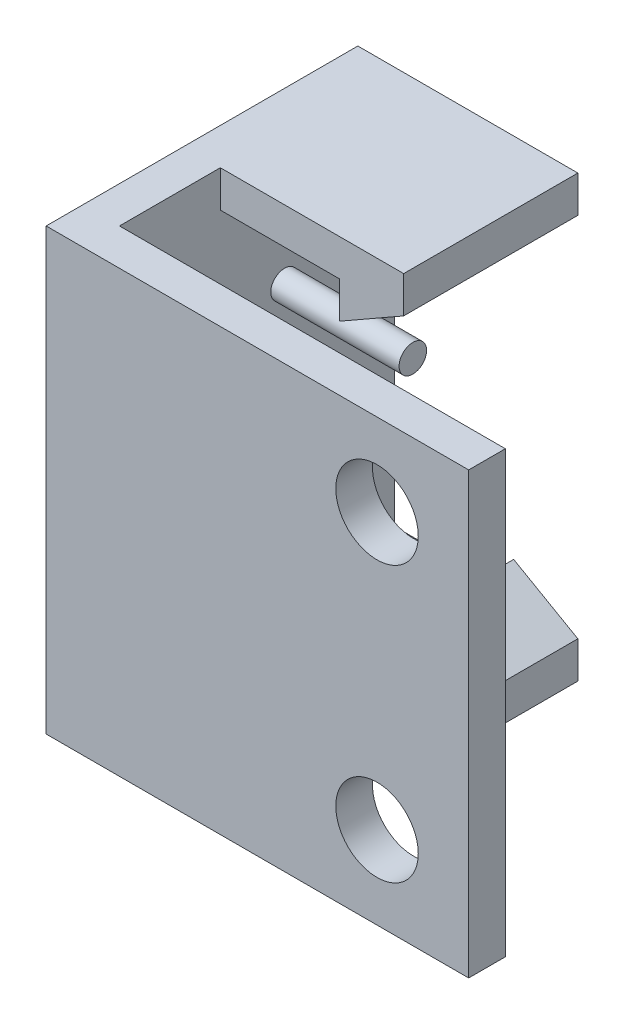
from build123d import *

# Parameters (mm, degrees)
SKIZZE1_W                       = 15
SKIZZE1_H                       = 24
AUFSATZ_LINEAR_AUSTRAGEN1_DEPTH = 2
SKIZZE2_W                       = 15
SKIZZE2_H                       = 2
AUFSATZ_LINEAR_AUSTRAGEN2_DEPTH = 10
AUFSATZ_LINEAR_AUSTRAGEN3_DEPTH = 10
SKIZZE7_W                       = 23.045869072
SKIZZE7_H                       = 24
SKIZZE7_R                       = 2.25
AUFSATZ_LINEAR_AUSTRAGEN4_DEPTH = 2
SKIZZE5_R                       = 0.75
AUFSATZ_LINEAR_AUSTRAGEN5_DEPTH = 7
SKIZZE8_W                       = 10
SKIZZE8_H                       = 5.5
SCHNITT_LINEAR_AUSTRAGEN2_DEPTH = 27


with BuildPart() as part:
    # Skizze1 → Aufsatz-Linear austragen1 (new body)
    with BuildSketch(Plane(origin=(0, 0, 0), x_dir=(0, 0, -1), z_dir=(1, 0, 0))):
        with Locations((7.5, 12)):
            Rectangle(SKIZZE1_W, SKIZZE1_H)
    extrude(amount=AUFSATZ_LINEAR_AUSTRAGEN1_DEPTH)

    # Skizze2 → Aufsatz-Linear austragen2 (add)
    with BuildSketch(Plane(origin=(2, 0, 0), x_dir=(0, 0, -1), z_dir=(1, 0, 0))):
        with Locations((7.5, 23)):
            Rectangle(SKIZZE2_W, SKIZZE2_H)
        with Locations((7.5, 1)):
            Rectangle(SKIZZE2_W, SKIZZE2_H)
    extrude(amount=AUFSATZ_LINEAR_AUSTRAGEN2_DEPTH)

    # Skizze3 → Aufsatz-Linear austragen3 (add)
    with BuildSketch(Plane(origin=(0, 0, -15), x_dir=(-1, 0, 0), z_dir=(0, 0, -1))):
        Polygon((-12, 22), (-8.5, 20), (-8.5, 22), align=None)
        Polygon((-12, 2), (-8.5, 4), (-8.5, 2), align=None)
    extrude(amount=-AUFSATZ_LINEAR_AUSTRAGEN3_DEPTH)

    # Skizze7 → Aufsatz-Linear austragen4 (add)
    with BuildSketch(Plane.XY):
        with Locations((11.522934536, 12)):
            Rectangle(SKIZZE7_W, SKIZZE7_H)
        with Locations((18.045869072, 19.5)):
            Circle(SKIZZE7_R, mode=Mode.SUBTRACT)
        with Locations((18.045869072, 4.5)):
            Circle(SKIZZE7_R, mode=Mode.SUBTRACT)
    extrude(amount=AUFSATZ_LINEAR_AUSTRAGEN4_DEPTH)

    # Skizze5 → Aufsatz-Linear austragen5 (add)
    with BuildSketch(Plane(origin=(2, 0, 0), x_dir=(0, 0, -1), z_dir=(1, 0, 0))):
        with Locations(Location((9, 16.75, 0), (0, 0, 180))):
            Circle(SKIZZE5_R)
        with Locations(Location((9, 7.25, 0), (0, 0, 180))):
            Circle(SKIZZE5_R)
    extrude(amount=AUFSATZ_LINEAR_AUSTRAGEN5_DEPTH)

    # Skizze8 → Schnitt-Linear austragen2 (cut)
    with BuildSketch(Plane(origin=(0, 24, 0), x_dir=(1, 0, 0), z_dir=(0, 1, 0))):
        with Locations((7, 2.75)):
            Rectangle(SKIZZE8_W, SKIZZE8_H)
    extrude(amount=-SCHNITT_LINEAR_AUSTRAGEN2_DEPTH, mode=Mode.SUBTRACT)


solid = part.part
